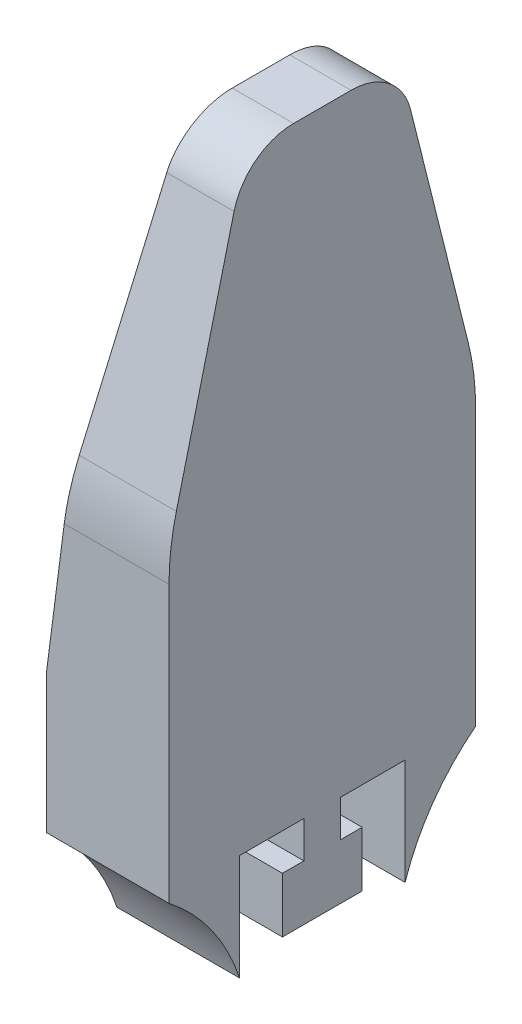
from build123d import *

# Parameters (mm, degrees)
BOSS_EXTRUDE2_DEPTH     = 20
CUT_EXTRUDE1_DEPTH      = 115.564392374
CUT_EXTRUDE1_DEPTH_BACK = 115.564392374


with BuildPart() as part:
    # Sketch2 → Boss-Extrude2 (new body)
    with BuildSketch(Plane(origin=(0, 0, 0), x_dir=(0, 0, -1), z_dir=(1, 0, 0))):
        with BuildLine():
            Line((-25, 10), (-25, 55.075774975))
            ThreePointArc((-25, 55.075774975), (-24.700302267, 59.963105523), (-23.805700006, 64.777199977))
            Line((-23.805700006, 64.777199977), (-14.393660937, 102.42535625))
            ThreePointArc((-14.393660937, 102.42535625), (-10.84635803, 107.88205438), (-4.692235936, 110))
            Line((-4.692235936, 110), (4.692235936, 110))
            ThreePointArc((4.692235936, 110), (10.84635803, 107.88205438), (14.393660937, 102.42535625))
            Line((14.393660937, 102.42535625), (23.805700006, 64.777199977))
            ThreePointArc((23.805700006, 64.777199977), (24.700302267, 59.963105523), (25, 55.075774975))
            Line((25, 55.075774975), (25, 10))
            ThreePointArc((25, 10), (18.038591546, 2.709992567), (13.5, -6.290374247))
            Line((13.5, -6.290374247), (13.5, 11))
            Line((13.5, 11), (3, 11))
            Line((3, 11), (3, 5))
            Line((3, 5), (6.5, 5))
            Line((6.5, 5), (6.5, -4))
            Line((6.5, -4), (-6.5, -4))
            Line((-6.5, -4), (-6.5, 5))
            Line((-6.5, 5), (-3, 5))
            Line((-3, 5), (-3, 11))
            Line((-3, 11), (-13.5, 11))
            Line((-13.5, 11), (-13.5, -6.290374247))
            ThreePointArc((-13.5, -6.290374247), (-18.038591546, 2.709992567), (-25, 10))
        make_face()
    extrude(amount=-BOSS_EXTRUDE2_DEPTH)

    # Sketch3 → Cut-Extrude1 (cut, two sides: drawn at the far end of the back side and taken through both)
    with BuildSketch(Plane.XY.offset(-CUT_EXTRUDE1_DEPTH_BACK)):
        Polygon((-10, 110), (-20, 32.537887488), (-20, 110), align=None)
    extrude(amount=CUT_EXTRUDE1_DEPTH + CUT_EXTRUDE1_DEPTH_BACK, mode=Mode.SUBTRACT)


solid = part.part
